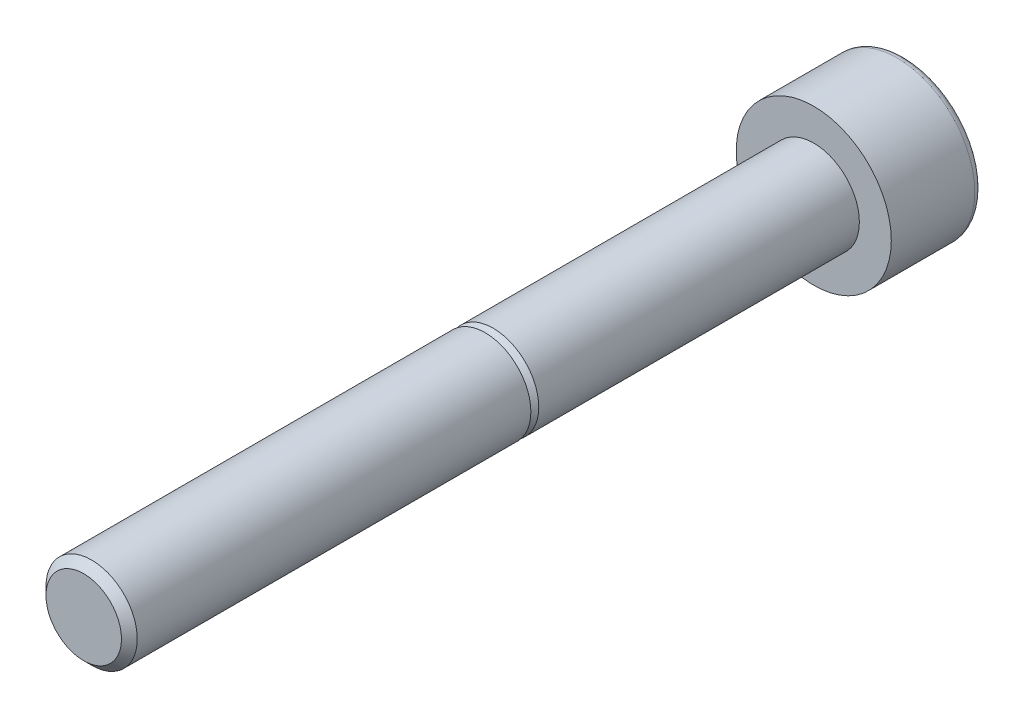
ISO-10303-21;
HEADER;
FILE_DESCRIPTION(('STEP AP214'),'2;1');
FILE_NAME('part.step','',(''),(''),'','','');
FILE_SCHEMA(('AUTOMOTIVE_DESIGN { 1 0 10303 214 1 1 1 1 }'));
ENDSEC;
DATA;
#1=APPLICATION_CONTEXT('core data for automotive mechanical design processes');
#2=APPLICATION_PROTOCOL_DEFINITION('international standard','automotive_design',2000,#1);
#3=PRODUCT_CONTEXT('',#1,'mechanical');
#4=PRODUCT('Part','Part','',(#3));
#5=PRODUCT_RELATED_PRODUCT_CATEGORY('part','',(#4));
#6=PRODUCT_DEFINITION_FORMATION('','',#4);
#7=PRODUCT_DEFINITION_CONTEXT('part definition',#1,'design');
#8=PRODUCT_DEFINITION('design','',#6,#7);
#9=PRODUCT_DEFINITION_SHAPE('','',#8);
#10=(LENGTH_UNIT() NAMED_UNIT(*) SI_UNIT(.MILLI.,.METRE.));
#11=(NAMED_UNIT(*) PLANE_ANGLE_UNIT() SI_UNIT($,.RADIAN.));
#12=(NAMED_UNIT(*) SI_UNIT($,.STERADIAN.) SOLID_ANGLE_UNIT());
#13=UNCERTAINTY_MEASURE_WITH_UNIT(LENGTH_MEASURE(1.E-05),#10,'distance_accuracy_value','');
#14=(GEOMETRIC_REPRESENTATION_CONTEXT(3) GLOBAL_UNCERTAINTY_ASSIGNED_CONTEXT((#13)) GLOBAL_UNIT_ASSIGNED_CONTEXT((#10,
#11,#12)) REPRESENTATION_CONTEXT('',''));
#15=CARTESIAN_POINT('',(0.,0.,0.));
#16=DIRECTION('',(0.,0.,1.));
#17=DIRECTION('',(1.,0.,0.));
#18=AXIS2_PLACEMENT_3D('',#15,#16,#17);
#19=CARTESIAN_POINT('',(0.,0.,-2.50799999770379));
#20=DIRECTION('',(0.,0.,-1.));
#21=DIRECTION('',(-1.,0.,0.));
#22=AXIS2_PLACEMENT_3D('',#19,#20,#21);
#23=CONICAL_SURFACE('',#22,2.32325639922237,1.04719755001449);
#24=CARTESIAN_POINT('',(-1.15469999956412,1.99999906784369,-2.50000000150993));
#25=CARTESIAN_POINT('',(-1.05991057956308,1.9999990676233,-2.4726337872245));
#26=CARTESIAN_POINT('',(-0.964371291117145,1.99999906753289,-2.44757924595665));
#27=CARTESIAN_POINT('',(-0.771740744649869,1.9999990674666,-2.4032984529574));
#28=CARTESIAN_POINT('',(-0.674646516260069,1.99999906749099,-2.38408524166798));
#29=CARTESIAN_POINT('',(-0.481547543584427,1.99999906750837,-2.35318807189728));
#30=CARTESIAN_POINT('',(-0.385569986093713,1.99999906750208,-2.34133938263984));
#31=CARTESIAN_POINT('',(-0.19306114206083,1.99999906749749,-2.32543322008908));
#32=CARTESIAN_POINT('',(-0.0965305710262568,1.99999906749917,-2.32136728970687));
#33=CARTESIAN_POINT('',(0.0965305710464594,1.9999990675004,-2.3213672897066));
#34=CARTESIAN_POINT('',(0.193061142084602,1.99999906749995,-2.3254332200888));
#35=CARTESIAN_POINT('',(0.385569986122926,1.99999906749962,-2.3413393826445));
#36=CARTESIAN_POINT('',(0.481547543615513,1.99999906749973,-2.35318807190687));
#37=CARTESIAN_POINT('',(0.674646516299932,1.99999906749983,-2.38408524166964));
#38=CARTESIAN_POINT('',(0.771740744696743,1.99999906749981,-2.40329845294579));
#39=CARTESIAN_POINT('',(0.964371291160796,1.99999906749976,-2.44757924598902));
#40=CARTESIAN_POINT('',(1.05991057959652,1.99999906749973,-2.47263378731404));
#41=CARTESIAN_POINT('',(1.15469999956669,1.99999906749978,-2.50000000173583));
#42=B_SPLINE_CURVE_WITH_KNOTS('',3,(#24,#25,#26,#27,#28,#29,#30,#31,#32,#33,#34,#35,#36,#37,#38,
#39,#40,#41),.UNSPECIFIED.,.F.,.F.,(4,2,2,2,2,2,2,2,4),(0.,0.296073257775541,0.592802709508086,
0.882630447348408,1.1721430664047,1.46165568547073,1.75148342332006,2.04821287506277,
2.3442861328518),.UNSPECIFIED.);
#43=CARTESIAN_POINT('',(-1.15469999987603,1.99999906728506,-2.50000000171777));
#44=VERTEX_POINT('',#43);
#45=CARTESIAN_POINT('',(1.1546999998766,1.99999906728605,-2.50000000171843));
#46=VERTEX_POINT('',#45);
#47=EDGE_CURVE('E115',#44,#46,#42,.T.);
#48=ORIENTED_EDGE('',*,*,#47,.T.);
#49=CARTESIAN_POINT('',(1.15470000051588,1.99999906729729,-2.50000000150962));
#50=CARTESIAN_POINT('',(1.20544207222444,1.91211122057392,-2.47069556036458));
#51=CARTESIAN_POINT('',(1.25662214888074,1.82346472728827,-2.44404470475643));
#52=CARTESIAN_POINT('',(1.35986845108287,1.64463688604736,-2.39752643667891));
#53=CARTESIAN_POINT('',(1.41193651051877,1.55445236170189,-2.37767547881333));
#54=CARTESIAN_POINT('',(1.51542737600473,1.37520092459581,-2.34677603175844));
#55=CARTESIAN_POINT('',(1.56683426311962,1.28616158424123,-2.3355218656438));
#56=CARTESIAN_POINT('',(1.66988979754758,1.10766416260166,-2.32208925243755));
#57=CARTESIAN_POINT('',(1.72153807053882,1.01820672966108,-2.31989967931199));
#58=CARTESIAN_POINT('',(1.81803732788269,0.851065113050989,-2.3244663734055));
#59=CARTESIAN_POINT('',(1.86290279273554,0.773355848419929,-2.33010136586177));
#60=CARTESIAN_POINT('',(1.95234143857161,0.618443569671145,-2.3479573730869));
#61=CARTESIAN_POINT('',(1.99691431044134,0.541241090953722,-2.36018448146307));
#62=CARTESIAN_POINT('',(2.0865372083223,0.38600967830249,-2.39074988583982));
#63=CARTESIAN_POINT('',(2.13157589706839,0.30800038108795,-2.40921768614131));
#64=CARTESIAN_POINT('',(2.22098171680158,0.153144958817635,-2.45113178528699));
#65=CARTESIAN_POINT('',(2.26534999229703,0.0762968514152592,-2.47456824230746));
#66=CARTESIAN_POINT('',(2.30939999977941,3.82071577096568E-10,-2.50000000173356));
#67=B_SPLINE_CURVE_WITH_KNOTS('',3,(#49,#50,#51,#52,#53,#54,#55,#56,#57,#58,#59,#60,#61,#62,#63,
#64,#65,#66),.UNSPECIFIED.,.F.,.F.,(4,2,2,2,2,2,2,2,4),(0.,0.317015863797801,0.634793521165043,
0.944707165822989,1.25424030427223,1.52370707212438,1.79342335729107,2.0691206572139,
2.34427687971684),.UNSPECIFIED.);
#68=CARTESIAN_POINT('',(2.30939999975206,0.,-2.50000000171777));
#69=VERTEX_POINT('',#68);
#70=EDGE_CURVE('E97',#46,#69,#67,.T.);
#71=ORIENTED_EDGE('',*,*,#70,.T.);
#72=CARTESIAN_POINT('',(2.3094000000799,-5.49438004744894E-10,-2.50000000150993));
#73=CARTESIAN_POINT('',(2.25865792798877,-0.0878878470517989,-2.47069556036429));
#74=CARTESIAN_POINT('',(2.20747785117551,-0.176534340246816,-2.44404470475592));
#75=CARTESIAN_POINT('',(2.10423154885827,-0.355362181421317,-2.3975264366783));
#76=CARTESIAN_POINT('',(2.0521634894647,-0.445546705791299,-2.37767547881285));
#77=CARTESIAN_POINT('',(1.94867262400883,-0.624798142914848,-2.34677603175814));
#78=CARTESIAN_POINT('',(1.89726573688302,-0.713837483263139,-2.33552186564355));
#79=CARTESIAN_POINT('',(1.7942102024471,-0.892334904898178,-2.32208925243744));
#80=CARTESIAN_POINT('',(1.74256192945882,-0.98179233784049,-2.31989967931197));
#81=CARTESIAN_POINT('',(1.64606267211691,-1.14893395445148,-2.32446637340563));
#82=CARTESIAN_POINT('',(1.60119720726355,-1.22664321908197,-2.33010136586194));
#83=CARTESIAN_POINT('',(1.51175856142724,-1.38155549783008,-2.34795737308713));
#84=CARTESIAN_POINT('',(1.4671856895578,-1.4587579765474,-2.36018448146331));
#85=CARTESIAN_POINT('',(1.3775627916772,-1.61398938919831,-2.39074988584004));
#86=CARTESIAN_POINT('',(1.3325241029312,-1.69199868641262,-2.40921768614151));
#87=CARTESIAN_POINT('',(1.24311828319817,-1.84685410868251,-2.45113178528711));
#88=CARTESIAN_POINT('',(1.19875000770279,-1.92370221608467,-2.47456824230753));
#89=CARTESIAN_POINT('',(1.15470000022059,-1.99999906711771,-2.50000000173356));
#90=B_SPLINE_CURVE_WITH_KNOTS('',3,(#72,#73,#74,#75,#76,#77,#78,#79,#80,#81,#82,#83,#84,#85,#86,
#87,#88,#89),.UNSPECIFIED.,.F.,.F.,(4,2,2,2,2,2,2,2,4),(0.,0.317015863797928,0.634793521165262,
0.94470716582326,1.25424030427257,1.52370707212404,1.79342335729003,2.06912065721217,
2.34427687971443),.UNSPECIFIED.);
#91=CARTESIAN_POINT('',(1.15469999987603,-1.99999906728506,-2.50000000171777));
#92=VERTEX_POINT('',#91);
#93=EDGE_CURVE('E93',#69,#92,#90,.T.);
#94=ORIENTED_EDGE('',*,*,#93,.T.);
#95=CARTESIAN_POINT('',(1.15469999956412,-1.99999906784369,-2.50000000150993));
#96=CARTESIAN_POINT('',(1.0599105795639,-1.99999906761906,-2.4726337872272));
#97=CARTESIAN_POINT('',(0.964371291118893,-1.99999906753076,-2.44757924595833));
#98=CARTESIAN_POINT('',(0.771740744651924,-1.99999906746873,-2.40329845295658));
#99=CARTESIAN_POINT('',(0.674646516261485,-1.99999906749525,-2.38408524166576));
#100=CARTESIAN_POINT('',(0.481547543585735,-1.99999906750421,-2.35318807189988));
#101=CARTESIAN_POINT('',(0.385569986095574,-1.99999906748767,-2.34133938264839));
#102=CARTESIAN_POINT('',(0.193061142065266,-1.99999906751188,-2.32543322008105));
#103=CARTESIAN_POINT('',(0.0965305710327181,-1.99999906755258,-2.32136728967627));
#104=CARTESIAN_POINT('',(-0.0965305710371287,-1.99999906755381,-2.32136728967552));
#105=CARTESIAN_POINT('',(-0.193061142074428,-1.99999906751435,-2.32543322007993));
#106=CARTESIAN_POINT('',(-0.385569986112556,-1.9999990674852,-2.34133938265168));
#107=CARTESIAN_POINT('',(-0.481547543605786,-1.99999906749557,-2.35318807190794));
#108=CARTESIAN_POINT('',(-0.674646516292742,-1.99999906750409,-2.38408524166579));
#109=CARTESIAN_POINT('',(-0.771740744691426,-1.99999906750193,-2.40329845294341));
#110=CARTESIAN_POINT('',(-0.964371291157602,-1.99999906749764,-2.44757924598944));
#111=CARTESIAN_POINT('',(-1.0599105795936,-1.99999906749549,-2.4726337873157));
#112=CARTESIAN_POINT('',(-1.15469999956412,-1.99999906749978,-2.50000000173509));
#113=B_SPLINE_CURVE_WITH_KNOTS('',3,(#95,#96,#97,#98,#99,#100,#101,#102,#103,#104,#105,#106,
#107,#108,#109,#110,#111,#112),.UNSPECIFIED.,.F.,.F.,(4,2,2,2,2,2,2,2,4),(0.,0.296073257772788,
0.592802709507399,0.882630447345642,1.17214306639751,1.4616556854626,1.75148342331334,
2.04821287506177,2.34428613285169),.UNSPECIFIED.);
#114=CARTESIAN_POINT('',(-1.15469999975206,-1.99999906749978,-2.50000000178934));
#115=VERTEX_POINT('',#114);
#116=EDGE_CURVE('E80',#92,#115,#113,.T.);
#117=ORIENTED_EDGE('',*,*,#116,.T.);
#118=CARTESIAN_POINT('',(-1.15470000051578,-1.99999906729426,-2.50000000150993));
#119=CARTESIAN_POINT('',(-1.20544207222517,-1.9121112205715,-2.47069556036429));
#120=CARTESIAN_POINT('',(-1.25662214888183,-1.82346472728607,-2.44404470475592));
#121=CARTESIAN_POINT('',(-1.35986845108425,-1.64463688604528,-2.3975264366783));
#122=CARTESIAN_POINT('',(-1.41193651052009,-1.5544523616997,-2.37767547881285));
#123=CARTESIAN_POINT('',(-1.51542737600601,-1.3752009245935,-2.34677603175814));
#124=CARTESIAN_POINT('',(-1.56683426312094,-1.28616158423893,-2.33552186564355));
#125=CARTESIAN_POINT('',(-1.66988979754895,-1.10766416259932,-2.32208925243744));
#126=CARTESIAN_POINT('',(-1.72153807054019,-1.01820672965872,-2.31989967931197));
#127=CARTESIAN_POINT('',(-1.81803732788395,-0.851065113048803,-2.32446637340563));
#128=CARTESIAN_POINT('',(-1.86290279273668,-0.773355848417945,-2.33010136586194));
#129=CARTESIAN_POINT('',(-1.95234143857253,-0.618443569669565,-2.34795737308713));
#130=CARTESIAN_POINT('',(-1.99691431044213,-0.541241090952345,-2.36018448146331));
#131=CARTESIAN_POINT('',(-2.08653720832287,-0.386009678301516,-2.39074988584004));
#132=CARTESIAN_POINT('',(-2.13157589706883,-0.308000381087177,-2.40921768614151));
#133=CARTESIAN_POINT('',(-2.2209817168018,-0.153144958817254,-2.45113178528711));
#134=CARTESIAN_POINT('',(-2.26534999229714,-0.0762968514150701,-2.47456824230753));
#135=CARTESIAN_POINT('',(-2.30939999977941,-3.82071077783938E-10,-2.50000000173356));
#136=B_SPLINE_CURVE_WITH_KNOTS('',3,(#118,#119,#120,#121,#122,#123,#124,#125,#126,#127,#128,
#129,#130,#131,#132,#133,#134,#135),.UNSPECIFIED.,.F.,.F.,(4,2,2,2,2,2,2,2,4),(0.,
0.317015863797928,0.634793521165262,0.94470716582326,1.25424030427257,1.52370707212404,
1.79342335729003,2.06912065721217,2.34427687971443),.UNSPECIFIED.);
#137=CARTESIAN_POINT('',(-2.30939999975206,0.,-2.50000000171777));
#138=VERTEX_POINT('',#137);
#139=EDGE_CURVE('E124',#115,#138,#136,.T.);
#140=ORIENTED_EDGE('',*,*,#139,.T.);
#141=CARTESIAN_POINT('',(-2.3094000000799,5.49438430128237E-10,-2.50000000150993));
#142=CARTESIAN_POINT('',(-2.25865792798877,0.0878878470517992,-2.47069556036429));
#143=CARTESIAN_POINT('',(-2.20747785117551,0.176534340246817,-2.44404470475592));
#144=CARTESIAN_POINT('',(-2.10423154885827,0.355362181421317,-2.3975264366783));
#145=CARTESIAN_POINT('',(-2.0521634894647,0.445546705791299,-2.37767547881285));
#146=CARTESIAN_POINT('',(-1.94867262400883,0.624798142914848,-2.34677603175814));
#147=CARTESIAN_POINT('',(-1.89726573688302,0.713837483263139,-2.33552186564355));
#148=CARTESIAN_POINT('',(-1.7942102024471,0.892334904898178,-2.32208925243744));
#149=CARTESIAN_POINT('',(-1.74256192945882,0.981792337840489,-2.31989967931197));
#150=CARTESIAN_POINT('',(-1.64606267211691,1.14893395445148,-2.32446637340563));
#151=CARTESIAN_POINT('',(-1.60119720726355,1.22664321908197,-2.33010136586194));
#152=CARTESIAN_POINT('',(-1.51175856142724,1.38155549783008,-2.34795737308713));
#153=CARTESIAN_POINT('',(-1.4671856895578,1.4587579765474,-2.36018448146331));
#154=CARTESIAN_POINT('',(-1.37756279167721,1.61398938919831,-2.39074988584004));
#155=CARTESIAN_POINT('',(-1.3325241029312,1.69199868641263,-2.40921768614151));
#156=CARTESIAN_POINT('',(-1.24311828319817,1.84685410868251,-2.45113178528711));
#157=CARTESIAN_POINT('',(-1.19875000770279,1.92370221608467,-2.47456824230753));
#158=CARTESIAN_POINT('',(-1.15470000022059,1.99999906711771,-2.50000000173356));
#159=B_SPLINE_CURVE_WITH_KNOTS('',3,(#141,#142,#143,#144,#145,#146,#147,#148,#149,#150,#151,
#152,#153,#154,#155,#156,#157,#158),.UNSPECIFIED.,.F.,.F.,(4,2,2,2,2,2,2,2,4),(0.,
0.317015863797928,0.634793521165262,0.94470716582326,1.25424030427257,1.52370707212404,
1.79342335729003,2.06912065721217,2.34427687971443),.UNSPECIFIED.);
#160=EDGE_CURVE('E120',#138,#44,#159,.T.);
#161=ORIENTED_EDGE('',*,*,#160,.T.);
#162=EDGE_LOOP('',(#48,#71,#94,#117,#140,#161));
#163=FACE_BOUND('',#162,.T.);
#164=CARTESIAN_POINT('',(0.,0.,-1.16666728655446));
#165=VERTEX_POINT('',#164);
#166=VERTEX_LOOP('',#165);
#167=FACE_BOUND('',#166,.T.);
#168=ADVANCED_FACE('F16',(#163,#167),#23,.F.);
#169=CARTESIAN_POINT('',(1.1547,-1.99999906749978,-5.));
#170=DIRECTION('',(0.,-1.,0.));
#171=DIRECTION('',(0.,0.,-1.));
#172=AXIS2_PLACEMENT_3D('',#169,#170,#171);
#173=PLANE('',#172);
#174=ORIENTED_EDGE('',*,*,#116,.F.);
#175=DIRECTION('',(0.,0.,1.));
#176=VECTOR('',#175,1.);
#177=CARTESIAN_POINT('',(1.1547,-1.99999906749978,-5.));
#178=LINE('',#177,#176);
#179=CARTESIAN_POINT('',(1.1547,-1.99999906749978,-5.));
#180=VERTEX_POINT('',#179);
#181=EDGE_CURVE('E84',#92,#180,#178,.F.);
#182=ORIENTED_EDGE('',*,*,#181,.T.);
#183=DIRECTION('',(-1.,0.,0.));
#184=VECTOR('',#183,1.);
#185=CARTESIAN_POINT('',(0.,-1.99999906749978,-5.));
#186=LINE('',#185,#184);
#187=CARTESIAN_POINT('',(-1.1547,-1.99999906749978,-5.));
#188=VERTEX_POINT('',#187);
#189=EDGE_CURVE('E199',#188,#180,#186,.F.);
#190=ORIENTED_EDGE('',*,*,#189,.F.);
#191=DIRECTION('',(0.,0.,1.));
#192=VECTOR('',#191,1.);
#193=CARTESIAN_POINT('',(-1.1547,-1.99999906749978,-5.));
#194=LINE('',#193,#192);
#195=EDGE_CURVE('E87',#188,#115,#194,.T.);
#196=ORIENTED_EDGE('',*,*,#195,.T.);
#197=EDGE_LOOP('',(#174,#182,#190,#196));
#198=FACE_BOUND('',#197,.T.);
#199=ADVANCED_FACE('F82',(#198),#173,.F.);
#200=CARTESIAN_POINT('',(2.3094,0.,-5.));
#201=DIRECTION('',(0.866025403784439,-0.5,0.));
#202=DIRECTION('',(0.5,0.866025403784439,0.));
#203=AXIS2_PLACEMENT_3D('',#200,#201,#202);
#204=PLANE('',#203);
#205=DIRECTION('',(0.,0.,1.));
#206=VECTOR('',#205,1.);
#207=CARTESIAN_POINT('',(2.3094,0.,-5.));
#208=LINE('',#207,#206);
#209=CARTESIAN_POINT('',(2.3094,0.,-5.));
#210=VERTEX_POINT('',#209);
#211=EDGE_CURVE('E100',#69,#210,#208,.F.);
#212=ORIENTED_EDGE('',*,*,#211,.T.);
#213=DIRECTION('',(0.5,0.866025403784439,0.));
#214=VECTOR('',#213,1.);
#215=CARTESIAN_POINT('',(1.1547,-1.99999906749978,-5.));
#216=LINE('',#215,#214);
#217=EDGE_CURVE('E104',#180,#210,#216,.T.);
#218=ORIENTED_EDGE('',*,*,#217,.F.);
#219=ORIENTED_EDGE('',*,*,#181,.F.);
#220=ORIENTED_EDGE('',*,*,#93,.F.);
#221=EDGE_LOOP('',(#212,#218,#219,#220));
#222=FACE_BOUND('',#221,.T.);
#223=ADVANCED_FACE('F102',(#222),#204,.F.);
#224=CARTESIAN_POINT('',(1.1547,1.99999906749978,-5.));
#225=DIRECTION('',(0.866025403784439,0.5,0.));
#226=DIRECTION('',(-0.5,0.866025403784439,0.));
#227=AXIS2_PLACEMENT_3D('',#224,#225,#226);
#228=PLANE('',#227);
#229=DIRECTION('',(0.,0.,1.));
#230=VECTOR('',#229,1.);
#231=CARTESIAN_POINT('',(1.1547,1.99999906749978,-5.));
#232=LINE('',#231,#230);
#233=CARTESIAN_POINT('',(1.1547,1.99999906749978,-5.));
#234=VERTEX_POINT('',#233);
#235=EDGE_CURVE('E113',#46,#234,#232,.F.);
#236=ORIENTED_EDGE('',*,*,#235,.T.);
#237=DIRECTION('',(-0.5,0.866025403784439,0.));
#238=VECTOR('',#237,1.);
#239=CARTESIAN_POINT('',(2.3094,0.,-5.));
#240=LINE('',#239,#238);
#241=EDGE_CURVE('E221',#210,#234,#240,.T.);
#242=ORIENTED_EDGE('',*,*,#241,.F.);
#243=ORIENTED_EDGE('',*,*,#211,.F.);
#244=ORIENTED_EDGE('',*,*,#70,.F.);
#245=EDGE_LOOP('',(#236,#242,#243,#244));
#246=FACE_BOUND('',#245,.T.);
#247=ADVANCED_FACE('F278',(#246),#228,.F.);
#248=CARTESIAN_POINT('',(-1.1547,1.99999906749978,-5.));
#249=DIRECTION('',(0.,1.,0.));
#250=DIRECTION('',(0.,0.,1.));
#251=AXIS2_PLACEMENT_3D('',#248,#249,#250);
#252=PLANE('',#251);
#253=ORIENTED_EDGE('',*,*,#47,.F.);
#254=DIRECTION('',(0.,0.,1.));
#255=VECTOR('',#254,1.);
#256=CARTESIAN_POINT('',(-1.1547,1.99999906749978,-5.));
#257=LINE('',#256,#255);
#258=CARTESIAN_POINT('',(-1.1547,1.99999906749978,-5.));
#259=VERTEX_POINT('',#258);
#260=EDGE_CURVE('E118',#44,#259,#257,.F.);
#261=ORIENTED_EDGE('',*,*,#260,.T.);
#262=DIRECTION('',(-1.,0.,0.));
#263=VECTOR('',#262,1.);
#264=CARTESIAN_POINT('',(0.,1.99999906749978,-5.));
#265=LINE('',#264,#263);
#266=EDGE_CURVE('E216',#234,#259,#265,.T.);
#267=ORIENTED_EDGE('',*,*,#266,.F.);
#268=ORIENTED_EDGE('',*,*,#235,.F.);
#269=EDGE_LOOP('',(#253,#261,#267,#268));
#270=FACE_BOUND('',#269,.T.);
#271=ADVANCED_FACE('F281',(#270),#252,.F.);
#272=CARTESIAN_POINT('',(-2.3094,0.,-5.));
#273=DIRECTION('',(-0.866025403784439,0.5,0.));
#274=DIRECTION('',(-0.5,-0.866025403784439,0.));
#275=AXIS2_PLACEMENT_3D('',#272,#273,#274);
#276=PLANE('',#275);
#277=DIRECTION('',(0.,0.,1.));
#278=VECTOR('',#277,1.);
#279=CARTESIAN_POINT('',(-2.3094,0.,-5.));
#280=LINE('',#279,#278);
#281=CARTESIAN_POINT('',(-2.3094,0.,-5.));
#282=VERTEX_POINT('',#281);
#283=EDGE_CURVE('E125',#138,#282,#280,.F.);
#284=ORIENTED_EDGE('',*,*,#283,.T.);
#285=DIRECTION('',(-0.5,-0.866025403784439,0.));
#286=VECTOR('',#285,1.);
#287=CARTESIAN_POINT('',(-1.1547,1.99999906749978,-5.));
#288=LINE('',#287,#286);
#289=EDGE_CURVE('E211',#259,#282,#288,.T.);
#290=ORIENTED_EDGE('',*,*,#289,.F.);
#291=ORIENTED_EDGE('',*,*,#260,.F.);
#292=ORIENTED_EDGE('',*,*,#160,.F.);
#293=EDGE_LOOP('',(#284,#290,#291,#292));
#294=FACE_BOUND('',#293,.T.);
#295=ADVANCED_FACE('F285',(#294),#276,.F.);
#296=CARTESIAN_POINT('',(-1.1547,-1.99999906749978,-5.));
#297=DIRECTION('',(-0.866025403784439,-0.5,0.));
#298=DIRECTION('',(0.5,-0.866025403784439,0.));
#299=AXIS2_PLACEMENT_3D('',#296,#297,#298);
#300=PLANE('',#299);
#301=ORIENTED_EDGE('',*,*,#195,.F.);
#302=DIRECTION('',(0.5,-0.866025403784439,0.));
#303=VECTOR('',#302,1.);
#304=CARTESIAN_POINT('',(-2.3094,0.,-5.));
#305=LINE('',#304,#303);
#306=EDGE_CURVE('E208',#282,#188,#305,.T.);
#307=ORIENTED_EDGE('',*,*,#306,.F.);
#308=ORIENTED_EDGE('',*,*,#283,.F.);
#309=ORIENTED_EDGE('',*,*,#139,.F.);
#310=EDGE_LOOP('',(#301,#307,#308,#309));
#311=FACE_BOUND('',#310,.T.);
#312=ADVANCED_FACE('F149',(#311),#300,.F.);
#313=CARTESIAN_POINT('',(0.,1.9125,-5.));
#314=DIRECTION('',(0.,0.,-1.));
#315=DIRECTION('',(-1.,0.,0.));
#316=AXIS2_PLACEMENT_3D('',#313,#314,#315);
#317=PLANE('',#316);
#318=ORIENTED_EDGE('',*,*,#289,.T.);
#319=ORIENTED_EDGE('',*,*,#306,.T.);
#320=ORIENTED_EDGE('',*,*,#189,.T.);
#321=ORIENTED_EDGE('',*,*,#217,.T.);
#322=ORIENTED_EDGE('',*,*,#241,.T.);
#323=ORIENTED_EDGE('',*,*,#266,.T.);
#324=EDGE_LOOP('',(#318,#319,#320,#321,#322,#323));
#325=FACE_BOUND('',#324,.T.);
#326=CARTESIAN_POINT('',(0.,0.,-5.));
#327=DIRECTION('',(0.,0.,1.));
#328=DIRECTION('',(1.,0.,0.));
#329=AXIS2_PLACEMENT_3D('',#326,#327,#328);
#330=CIRCLE('',#329,3.825);
#331=CARTESIAN_POINT('',(3.825,0.,-5.));
#332=VERTEX_POINT('',#331);
#333=CARTESIAN_POINT('',(0.,3.825,-5.));
#334=VERTEX_POINT('',#333);
#335=EDGE_CURVE('E195',#332,#334,#330,.T.);
#336=ORIENTED_EDGE('',*,*,#335,.F.);
#337=CARTESIAN_POINT('',(0.,0.,-5.));
#338=DIRECTION('',(0.,0.,1.));
#339=DIRECTION('',(-1.,0.,0.));
#340=AXIS2_PLACEMENT_3D('',#337,#338,#339);
#341=CIRCLE('',#340,3.825);
#342=CARTESIAN_POINT('',(-3.825,0.,-5.));
#343=VERTEX_POINT('',#342);
#344=EDGE_CURVE('E37',#343,#332,#341,.T.);
#345=ORIENTED_EDGE('',*,*,#344,.F.);
#346=CARTESIAN_POINT('',(0.,0.,-5.));
#347=DIRECTION('',(0.,0.,1.));
#348=DIRECTION('',(0.,1.,0.));
#349=AXIS2_PLACEMENT_3D('',#346,#347,#348);
#350=CIRCLE('',#349,3.825);
#351=EDGE_CURVE('E132',#334,#343,#350,.T.);
#352=ORIENTED_EDGE('',*,*,#351,.F.);
#353=EDGE_LOOP('',(#336,#345,#352));
#354=FACE_BOUND('',#353,.T.);
#355=ADVANCED_FACE('F139',(#325,#354),#317,.T.);
#356=CARTESIAN_POINT('',(0.,0.,-4.575));
#357=DIRECTION('',(0.,0.,1.));
#358=DIRECTION('',(1.,0.,0.));
#359=AXIS2_PLACEMENT_3D('',#356,#357,#358);
#360=TOROIDAL_SURFACE('',#359,3.825,0.425);
#361=ORIENTED_EDGE('',*,*,#344,.T.);
#362=ORIENTED_EDGE('',*,*,#335,.T.);
#363=ORIENTED_EDGE('',*,*,#351,.T.);
#364=EDGE_LOOP('',(#361,#362,#363));
#365=FACE_BOUND('',#364,.T.);
#366=CARTESIAN_POINT('',(0.,0.,-4.575));
#367=DIRECTION('',(0.,0.,1.));
#368=DIRECTION('',(1.,0.,0.));
#369=AXIS2_PLACEMENT_3D('',#366,#367,#368);
#370=CIRCLE('',#369,4.25);
#371=CARTESIAN_POINT('',(4.25,0.,-4.575));
#372=VERTEX_POINT('',#371);
#373=EDGE_CURVE('E180',#372,#372,#370,.T.);
#374=ORIENTED_EDGE('',*,*,#373,.F.);
#375=EDGE_LOOP('',(#374));
#376=FACE_BOUND('',#375,.T.);
#377=ADVANCED_FACE('F148',(#365,#376),#360,.T.);
#378=CARTESIAN_POINT('',(0.,0.,-2.2875));
#379=DIRECTION('',(0.,0.,1.));
#380=DIRECTION('',(1.,0.,0.));
#381=AXIS2_PLACEMENT_3D('',#378,#379,#380);
#382=CYLINDRICAL_SURFACE('',#381,4.25);
#383=CARTESIAN_POINT('',(0.,0.,0.));
#384=DIRECTION('',(0.,0.,1.));
#385=DIRECTION('',(1.,0.,0.));
#386=AXIS2_PLACEMENT_3D('',#383,#384,#385);
#387=CIRCLE('',#386,4.25);
#388=CARTESIAN_POINT('',(4.25,0.,0.));
#389=VERTEX_POINT('',#388);
#390=EDGE_CURVE('E183',#389,#389,#387,.T.);
#391=ORIENTED_EDGE('',*,*,#390,.F.);
#392=EDGE_LOOP('',(#391));
#393=FACE_BOUND('',#392,.T.);
#394=ORIENTED_EDGE('',*,*,#373,.T.);
#395=EDGE_LOOP('',(#394));
#396=FACE_BOUND('',#395,.T.);
#397=ADVANCED_FACE('F326',(#393,#396),#382,.T.);
#398=CARTESIAN_POINT('',(0.,3.375,0.));
#399=DIRECTION('',(0.,0.,1.));
#400=DIRECTION('',(1.,0.,0.));
#401=AXIS2_PLACEMENT_3D('',#398,#399,#400);
#402=PLANE('',#401);
#403=CARTESIAN_POINT('',(0.,0.,0.));
#404=DIRECTION('',(0.,0.,1.));
#405=DIRECTION('',(1.,0.,0.));
#406=AXIS2_PLACEMENT_3D('',#403,#404,#405);
#407=CIRCLE('',#406,2.5);
#408=CARTESIAN_POINT('',(2.5,0.,0.));
#409=VERTEX_POINT('',#408);
#410=EDGE_CURVE('E179',#409,#409,#407,.T.);
#411=ORIENTED_EDGE('',*,*,#410,.F.);
#412=EDGE_LOOP('',(#411));
#413=FACE_BOUND('',#412,.T.);
#414=ORIENTED_EDGE('',*,*,#390,.T.);
#415=EDGE_LOOP('',(#414));
#416=FACE_BOUND('',#415,.T.);
#417=ADVANCED_FACE('F323',(#413,#416),#402,.T.);
#418=CARTESIAN_POINT('',(0.,0.,19.7835));
#419=DIRECTION('',(0.,0.,1.));
#420=DIRECTION('',(1.,0.,0.));
#421=AXIS2_PLACEMENT_3D('',#418,#419,#420);
#422=CYLINDRICAL_SURFACE('',#421,2.5);
#423=ORIENTED_EDGE('',*,*,#410,.T.);
#424=EDGE_LOOP('',(#423));
#425=FACE_BOUND('',#424,.T.);
#426=CARTESIAN_POINT('',(0.,0.,17.5669999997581));
#427=DIRECTION('',(0.,0.,-1.));
#428=DIRECTION('',(0.,1.,0.));
#429=AXIS2_PLACEMENT_3D('',#426,#427,#428);
#430=CIRCLE('',#429,2.4999999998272);
#431=CARTESIAN_POINT('',(0.,2.4999999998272,17.5669999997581));
#432=VERTEX_POINT('',#431);
#433=EDGE_CURVE('E175',#432,#432,#430,.F.);
#434=ORIENTED_EDGE('',*,*,#433,.F.);
#435=EDGE_LOOP('',(#434));
#436=FACE_BOUND('',#435,.T.);
#437=ADVANCED_FACE('F319',(#425,#436),#422,.T.);
#438=CARTESIAN_POINT('',(0.,0.,17.5669999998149));
#439=DIRECTION('',(0.,0.,-1.));
#440=DIRECTION('',(-1.,0.,0.));
#441=AXIS2_PLACEMENT_3D('',#438,#439,#440);
#442=CONICAL_SURFACE('',#441,2.49999999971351,0.785398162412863);
#443=ORIENTED_EDGE('',*,*,#433,.T.);
#444=EDGE_LOOP('',(#443));
#445=FACE_BOUND('',#444,.T.);
#446=CARTESIAN_POINT('',(0.,0.,18.0000000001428));
#447=DIRECTION('',(0.,0.,-1.));
#448=DIRECTION('',(-1.,0.,0.));
#449=AXIS2_PLACEMENT_3D('',#446,#447,#448);
#450=CIRCLE('',#449,2.06700000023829);
#451=CARTESIAN_POINT('',(-2.06700000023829,0.,18.0000000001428));
#452=VERTEX_POINT('',#451);
#453=EDGE_CURVE('E178',#452,#452,#450,.T.);
#454=ORIENTED_EDGE('',*,*,#453,.T.);
#455=EDGE_LOOP('',(#454));
#456=FACE_BOUND('',#455,.T.);
#457=ADVANCED_FACE('F312',(#445,#456),#442,.T.);
#458=CARTESIAN_POINT('',(0.,1.0335,40.));
#459=DIRECTION('',(0.,0.,1.));
#460=DIRECTION('',(1.,0.,0.));
#461=AXIS2_PLACEMENT_3D('',#458,#459,#460);
#462=PLANE('',#461);
#463=CARTESIAN_POINT('',(0.,0.,40.0000000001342));
#464=DIRECTION('',(0.,0.,-1.));
#465=DIRECTION('',(-1.,0.,0.));
#466=AXIS2_PLACEMENT_3D('',#463,#464,#465);
#467=CIRCLE('',#466,2.06700000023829);
#468=CARTESIAN_POINT('',(-2.0670000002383,0.,40.0000000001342));
#469=VERTEX_POINT('',#468);
#470=EDGE_CURVE('E233',#469,#469,#467,.T.);
#471=ORIENTED_EDGE('',*,*,#470,.F.);
#472=EDGE_LOOP('',(#471));
#473=FACE_BOUND('',#472,.T.);
#474=ADVANCED_FACE('F307',(#473),#462,.T.);
#475=CARTESIAN_POINT('',(0.,2.2835,18.));
#476=DIRECTION('',(0.,0.,1.));
#477=DIRECTION('',(1.,0.,0.));
#478=AXIS2_PLACEMENT_3D('',#475,#476,#477);
#479=PLANE('',#478);
#480=ORIENTED_EDGE('',*,*,#453,.F.);
#481=EDGE_LOOP('',(#480));
#482=FACE_BOUND('',#481,.T.);
#483=CARTESIAN_POINT('',(0.,0.,18.));
#484=DIRECTION('',(0.,0.,1.));
#485=DIRECTION('',(1.,0.,0.));
#486=AXIS2_PLACEMENT_3D('',#483,#484,#485);
#487=CIRCLE('',#486,2.5);
#488=CARTESIAN_POINT('',(2.5,0.,18.));
#489=VERTEX_POINT('',#488);
#490=EDGE_CURVE('E28',#489,#489,#487,.T.);
#491=ORIENTED_EDGE('',*,*,#490,.F.);
#492=EDGE_LOOP('',(#491));
#493=FACE_BOUND('',#492,.T.);
#494=ADVANCED_FACE('F299',(#482,#493),#479,.F.);
#495=CARTESIAN_POINT('',(0.,0.,39.5669999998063));
#496=DIRECTION('',(0.,0.,-1.));
#497=DIRECTION('',(-1.,0.,0.));
#498=AXIS2_PLACEMENT_3D('',#495,#496,#497);
#499=CONICAL_SURFACE('',#498,2.49999999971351,0.785398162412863);
#500=ORIENTED_EDGE('',*,*,#470,.T.);
#501=EDGE_LOOP('',(#500));
#502=FACE_BOUND('',#501,.T.);
#503=CARTESIAN_POINT('',(0.,0.,39.567));
#504=DIRECTION('',(0.,0.,1.));
#505=DIRECTION('',(1.,0.,0.));
#506=AXIS2_PLACEMENT_3D('',#503,#504,#505);
#507=CIRCLE('',#506,2.5);
#508=CARTESIAN_POINT('',(2.49999999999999,0.,39.567));
#509=VERTEX_POINT('',#508);
#510=EDGE_CURVE('E10',#509,#509,#507,.F.);
#511=ORIENTED_EDGE('',*,*,#510,.F.);
#512=EDGE_LOOP('',(#511));
#513=FACE_BOUND('',#512,.T.);
#514=ADVANCED_FACE('F295',(#502,#513),#499,.T.);
#515=CARTESIAN_POINT('',(0.,0.,19.7835));
#516=DIRECTION('',(0.,0.,1.));
#517=DIRECTION('',(1.,0.,0.));
#518=AXIS2_PLACEMENT_3D('',#515,#516,#517);
#519=CYLINDRICAL_SURFACE('',#518,2.5);
#520=ORIENTED_EDGE('',*,*,#490,.T.);
#521=EDGE_LOOP('',(#520));
#522=FACE_BOUND('',#521,.T.);
#523=ORIENTED_EDGE('',*,*,#510,.T.);
#524=EDGE_LOOP('',(#523));
#525=FACE_BOUND('',#524,.T.);
#526=ADVANCED_FACE('F18',(#522,#525),#519,.T.);
#527=CLOSED_SHELL('',(#168,#199,#223,#247,#271,#295,#312,#355,#377,#397,#417,#437,#457,#474,
#494,#514,#526));
#528=MANIFOLD_SOLID_BREP('B1',#527);
#529=ADVANCED_BREP_SHAPE_REPRESENTATION('',(#18,#528),#14);
#530=SHAPE_DEFINITION_REPRESENTATION(#9,#529);
ENDSEC;
END-ISO-10303-21;
